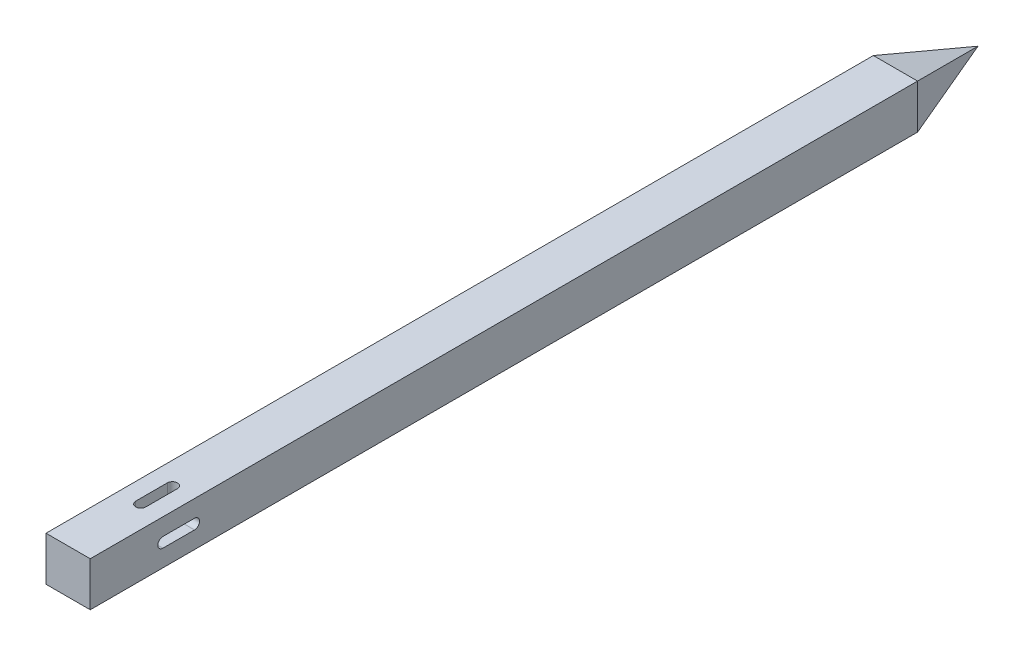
from build123d import *

# Parameters (mm, degrees)
AUFSATZ_LIN_GK_START           = -150
BR_U_H_W                       = 35
BR_U_H_H                       = 35
AUFSATZ_LIN_GK_DEPTH           = 720
SCHNITT_LIN_SPITZSCHR_GE_DEPTH = 572.341622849
KREISMUSTER_SPITZ_COUNT        = 4
SCHNITT_LIN_SCHLITZ_OB_DEPTH   = 572.341622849
KREISMUSTER_SCHLITZ_OB_COUNT   = 2
KREISMUSTER_SCHLITZ_OB_ANGLE   = 90


with BuildPart() as part:
    # Br u H → Aufsatz-Lin_GK (new body)
    with BuildSketch(Plane.XY.offset(AUFSATZ_LIN_GK_START)):
        Rectangle(BR_U_H_W, BR_U_H_H)
    extrude(amount=AUFSATZ_LIN_GK_DEPTH)

    # Spitzschr_ge → Schnitt-Lin_Spitzschr_ge (cut, through all)
    with BuildSketch(Plane(origin=(17.5, 0, 0), x_dir=(0, 0, -1), z_dir=(1, 0, 0))):
        Polygon((1551.003241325, -375.397687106), (150, 0), (84.689110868, 17.5), (-1316.314130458, 392.897687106), (-565.518756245, 3194.904169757), (2301.798615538, 2426.608795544), align=None)
    schnitt_lin_spitzschr_ge = extrude(amount=-SCHNITT_LIN_SPITZSCHR_GE_DEPTH, mode=Mode.SUBTRACT)

    # Kreismuster_Spitz: Schnitt-Lin_Spitzschr_ge ×4 about axis
    kreismuster_spitz_axis = Axis((0, 0, 0), (0, 0, 1))
    for i in range(1, KREISMUSTER_SPITZ_COUNT):
        add(schnitt_lin_spitzschr_ge.rotate(kreismuster_spitz_axis, i * 360 / KREISMUSTER_SPITZ_COUNT), mode=Mode.SUBTRACT)

    # Schlitz ob → Schnitt-Lin_Schlitz ob (cut, through all)
    with BuildSketch(Plane(origin=(17.5, 0, 0), x_dir=(0, 0, -1), z_dir=(1, 0, 0))):
        with BuildLine():
            Line((-487.5, -4), (-512.5, -4))
            ThreePointArc((-512.5, -4), (-516.5, 0), (-512.5, 4))
            Line((-512.5, 4), (-487.5, 4))
            ThreePointArc((-487.5, 4), (-483.5, 0), (-487.5, -4))
        make_face()
    schnitt_lin_schlitz_ob = extrude(amount=-SCHNITT_LIN_SCHLITZ_OB_DEPTH, mode=Mode.SUBTRACT)

    # Kreismuster_Schlitz ob: Schnitt-Lin_Schlitz ob ×2 about axis
    kreismuster_schlitz_ob_axis = Axis((0, 0, -70.413294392), (0, 0, 1))
    for i in range(1, KREISMUSTER_SCHLITZ_OB_COUNT):
        add(schnitt_lin_schlitz_ob.rotate(kreismuster_schlitz_ob_axis, i * KREISMUSTER_SCHLITZ_OB_ANGLE / (KREISMUSTER_SCHLITZ_OB_COUNT - 1)), mode=Mode.SUBTRACT)


solid = part.part
